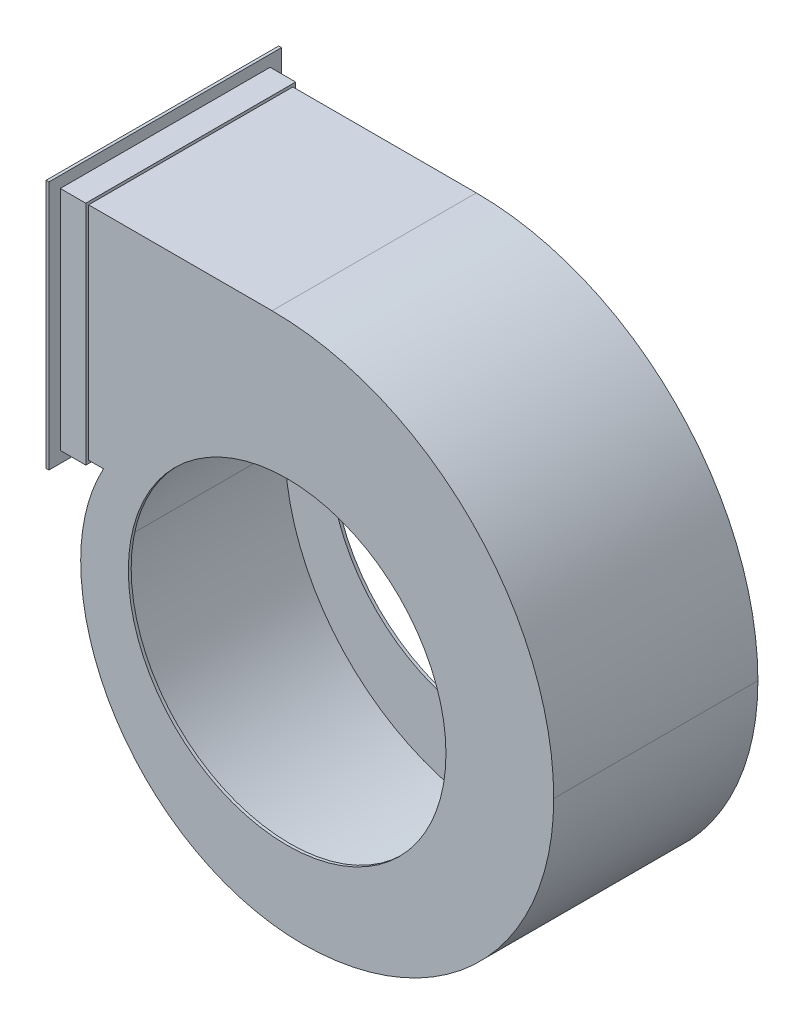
ISO-10303-21;
HEADER;
FILE_DESCRIPTION(('STEP AP214'),'2;1');
FILE_NAME('part.step','',(''),(''),'','','');
FILE_SCHEMA(('AUTOMOTIVE_DESIGN { 1 0 10303 214 1 1 1 1 }'));
ENDSEC;
DATA;
#1=APPLICATION_CONTEXT('core data for automotive mechanical design processes');
#2=APPLICATION_PROTOCOL_DEFINITION('international standard','automotive_design',2000,#1);
#3=PRODUCT_CONTEXT('',#1,'mechanical');
#4=PRODUCT('Part','Part','',(#3));
#5=PRODUCT_RELATED_PRODUCT_CATEGORY('part','',(#4));
#6=PRODUCT_DEFINITION_FORMATION('','',#4);
#7=PRODUCT_DEFINITION_CONTEXT('part definition',#1,'design');
#8=PRODUCT_DEFINITION('design','',#6,#7);
#9=PRODUCT_DEFINITION_SHAPE('','',#8);
#10=(LENGTH_UNIT() NAMED_UNIT(*) SI_UNIT(.MILLI.,.METRE.));
#11=(NAMED_UNIT(*) PLANE_ANGLE_UNIT() SI_UNIT($,.RADIAN.));
#12=(NAMED_UNIT(*) SI_UNIT($,.STERADIAN.) SOLID_ANGLE_UNIT());
#13=UNCERTAINTY_MEASURE_WITH_UNIT(LENGTH_MEASURE(1.E-05),#10,'distance_accuracy_value','');
#14=(GEOMETRIC_REPRESENTATION_CONTEXT(3) GLOBAL_UNCERTAINTY_ASSIGNED_CONTEXT((#13)) GLOBAL_UNIT_ASSIGNED_CONTEXT((#10,
#11,#12)) REPRESENTATION_CONTEXT('',''));
#15=CARTESIAN_POINT('',(0.,0.,0.));
#16=DIRECTION('',(0.,0.,1.));
#17=DIRECTION('',(1.,0.,0.));
#18=AXIS2_PLACEMENT_3D('',#15,#16,#17);
#19=CARTESIAN_POINT('',(-400.,528.007277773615,185.));
#20=DIRECTION('',(0.,0.,-1.));
#21=DIRECTION('',(-1.,0.,0.));
#22=AXIS2_PLACEMENT_3D('',#19,#20,#21);
#23=PLANE('',#22);
#24=DIRECTION('',(0.,1.,0.));
#25=VECTOR('',#24,1.);
#26=CARTESIAN_POINT('',(-395.,128.007277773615,185.));
#27=LINE('',#26,#25);
#28=CARTESIAN_POINT('',(-395.,128.007277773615,185.));
#29=VERTEX_POINT('',#28);
#30=CARTESIAN_POINT('',(-395.,528.007277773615,185.));
#31=VERTEX_POINT('',#30);
#32=EDGE_CURVE('E142',#29,#31,#27,.T.);
#33=ORIENTED_EDGE('',*,*,#32,.F.);
#34=DIRECTION('',(1.,0.,0.));
#35=VECTOR('',#34,1.);
#36=CARTESIAN_POINT('',(-400.,128.007277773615,185.));
#37=LINE('',#36,#35);
#38=CARTESIAN_POINT('',(-350.,128.007277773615,185.));
#39=VERTEX_POINT('',#38);
#40=EDGE_CURVE('E128',#29,#39,#37,.T.);
#41=ORIENTED_EDGE('',*,*,#40,.T.);
#42=DIRECTION('',(0.,1.,0.));
#43=VECTOR('',#42,1.);
#44=CARTESIAN_POINT('',(-350.,528.007277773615,185.));
#45=LINE('',#44,#43);
#46=CARTESIAN_POINT('',(-350.,528.007277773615,185.));
#47=VERTEX_POINT('',#46);
#48=EDGE_CURVE('E195',#39,#47,#45,.T.);
#49=ORIENTED_EDGE('',*,*,#48,.T.);
#50=DIRECTION('',(1.,0.,0.));
#51=VECTOR('',#50,1.);
#52=CARTESIAN_POINT('',(-400.,528.007277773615,185.));
#53=LINE('',#52,#51);
#54=EDGE_CURVE('E12',#31,#47,#53,.T.);
#55=ORIENTED_EDGE('',*,*,#54,.F.);
#56=EDGE_LOOP('',(#33,#41,#49,#55));
#57=FACE_BOUND('',#56,.T.);
#58=ADVANCED_FACE('F41',(#57),#23,.F.);
#59=CARTESIAN_POINT('',(-400.,528.007277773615,185.));
#60=DIRECTION('',(0.,-1.,0.));
#61=DIRECTION('',(1.,0.,0.));
#62=AXIS2_PLACEMENT_3D('',#59,#60,#61);
#63=PLANE('',#62);
#64=DIRECTION('',(0.,0.,-1.));
#65=VECTOR('',#64,1.);
#66=CARTESIAN_POINT('',(-395.,528.007277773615,185.));
#67=LINE('',#66,#65);
#68=CARTESIAN_POINT('',(-395.,528.007277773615,-185.));
#69=VERTEX_POINT('',#68);
#70=EDGE_CURVE('E54',#31,#69,#67,.T.);
#71=ORIENTED_EDGE('',*,*,#70,.F.);
#72=ORIENTED_EDGE('',*,*,#54,.T.);
#73=DIRECTION('',(0.,0.,-1.));
#74=VECTOR('',#73,1.);
#75=CARTESIAN_POINT('',(-350.,528.007277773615,185.));
#76=LINE('',#75,#74);
#77=CARTESIAN_POINT('',(-350.,528.007277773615,-185.));
#78=VERTEX_POINT('',#77);
#79=EDGE_CURVE('E197',#47,#78,#76,.T.);
#80=ORIENTED_EDGE('',*,*,#79,.T.);
#81=DIRECTION('',(1.,0.,0.));
#82=VECTOR('',#81,1.);
#83=CARTESIAN_POINT('',(-400.,528.007277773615,-185.));
#84=LINE('',#83,#82);
#85=EDGE_CURVE('E48',#69,#78,#84,.T.);
#86=ORIENTED_EDGE('',*,*,#85,.F.);
#87=EDGE_LOOP('',(#71,#72,#80,#86));
#88=FACE_BOUND('',#87,.T.);
#89=ADVANCED_FACE('F225',(#88),#63,.F.);
#90=CARTESIAN_POINT('',(-400.,528.007277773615,-185.));
#91=DIRECTION('',(0.,0.,1.));
#92=DIRECTION('',(1.,0.,0.));
#93=AXIS2_PLACEMENT_3D('',#90,#91,#92);
#94=PLANE('',#93);
#95=DIRECTION('',(0.,-1.,0.));
#96=VECTOR('',#95,1.);
#97=CARTESIAN_POINT('',(-395.,528.007277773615,-185.));
#98=LINE('',#97,#96);
#99=CARTESIAN_POINT('',(-395.,128.007277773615,-185.));
#100=VERTEX_POINT('',#99);
#101=EDGE_CURVE('E62',#69,#100,#98,.T.);
#102=ORIENTED_EDGE('',*,*,#101,.F.);
#103=ORIENTED_EDGE('',*,*,#85,.T.);
#104=DIRECTION('',(0.,-1.,0.));
#105=VECTOR('',#104,1.);
#106=CARTESIAN_POINT('',(-350.,528.007277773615,-185.));
#107=LINE('',#106,#105);
#108=CARTESIAN_POINT('',(-350.,128.007277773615,-185.));
#109=VERTEX_POINT('',#108);
#110=EDGE_CURVE('E200',#78,#109,#107,.T.);
#111=ORIENTED_EDGE('',*,*,#110,.T.);
#112=DIRECTION('',(1.,0.,0.));
#113=VECTOR('',#112,1.);
#114=CARTESIAN_POINT('',(-400.,128.007277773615,-185.));
#115=LINE('',#114,#113);
#116=EDGE_CURVE('E138',#100,#109,#115,.T.);
#117=ORIENTED_EDGE('',*,*,#116,.F.);
#118=EDGE_LOOP('',(#102,#103,#111,#117));
#119=FACE_BOUND('',#118,.T.);
#120=ADVANCED_FACE('F221',(#119),#94,.F.);
#121=CARTESIAN_POINT('',(-400.,128.007277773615,185.));
#122=DIRECTION('',(0.,1.,0.));
#123=DIRECTION('',(-1.,0.,0.));
#124=AXIS2_PLACEMENT_3D('',#121,#122,#123);
#125=PLANE('',#124);
#126=DIRECTION('',(0.,0.,1.));
#127=VECTOR('',#126,1.);
#128=CARTESIAN_POINT('',(-395.,128.007277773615,-185.));
#129=LINE('',#128,#127);
#130=EDGE_CURVE('E132',#100,#29,#129,.T.);
#131=ORIENTED_EDGE('',*,*,#130,.F.);
#132=ORIENTED_EDGE('',*,*,#116,.T.);
#133=DIRECTION('',(0.,0.,1.));
#134=VECTOR('',#133,1.);
#135=CARTESIAN_POINT('',(-350.,128.007277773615,185.));
#136=LINE('',#135,#134);
#137=EDGE_CURVE('E134',#109,#39,#136,.T.);
#138=ORIENTED_EDGE('',*,*,#137,.T.);
#139=ORIENTED_EDGE('',*,*,#40,.F.);
#140=EDGE_LOOP('',(#131,#132,#138,#139));
#141=FACE_BOUND('',#140,.T.);
#142=ADVANCED_FACE('F130',(#141),#125,.F.);
#143=CARTESIAN_POINT('',(-400.,128.007277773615,185.));
#144=DIRECTION('',(1.,0.,0.));
#145=DIRECTION('',(0.,1.,0.));
#146=AXIS2_PLACEMENT_3D('',#143,#144,#145);
#147=PLANE('',#146);
#148=DIRECTION('',(0.,1.,0.));
#149=VECTOR('',#148,1.);
#150=CARTESIAN_POINT('',(-400.,523.007277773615,180.));
#151=LINE('',#150,#149);
#152=CARTESIAN_POINT('',(-400.,133.007277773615,180.));
#153=VERTEX_POINT('',#152);
#154=CARTESIAN_POINT('',(-400.,523.007277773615,180.));
#155=VERTEX_POINT('',#154);
#156=EDGE_CURVE('E204',#153,#155,#151,.T.);
#157=ORIENTED_EDGE('',*,*,#156,.F.);
#158=DIRECTION('',(0.,0.,1.));
#159=VECTOR('',#158,1.);
#160=CARTESIAN_POINT('',(-400.,133.007277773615,180.));
#161=LINE('',#160,#159);
#162=CARTESIAN_POINT('',(-400.,133.007277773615,-180.));
#163=VERTEX_POINT('',#162);
#164=EDGE_CURVE('E211',#163,#153,#161,.T.);
#165=ORIENTED_EDGE('',*,*,#164,.F.);
#166=DIRECTION('',(0.,-1.,0.));
#167=VECTOR('',#166,1.);
#168=CARTESIAN_POINT('',(-400.,523.007277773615,-180.));
#169=LINE('',#168,#167);
#170=CARTESIAN_POINT('',(-400.,523.007277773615,-180.));
#171=VERTEX_POINT('',#170);
#172=EDGE_CURVE('E208',#171,#163,#169,.T.);
#173=ORIENTED_EDGE('',*,*,#172,.F.);
#174=DIRECTION('',(0.,0.,-1.));
#175=VECTOR('',#174,1.);
#176=CARTESIAN_POINT('',(-400.,523.007277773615,180.));
#177=LINE('',#176,#175);
#178=EDGE_CURVE('E206',#155,#171,#177,.T.);
#179=ORIENTED_EDGE('',*,*,#178,.F.);
#180=EDGE_LOOP('',(#157,#165,#173,#179));
#181=FACE_BOUND('',#180,.T.);
#182=DIRECTION('',(0.,0.,-1.));
#183=VECTOR('',#182,1.);
#184=CARTESIAN_POINT('',(-400.,548.007277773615,205.));
#185=LINE('',#184,#183);
#186=CARTESIAN_POINT('',(-400.,548.007277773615,205.));
#187=VERTEX_POINT('',#186);
#188=CARTESIAN_POINT('',(-400.,548.007277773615,-205.));
#189=VERTEX_POINT('',#188);
#190=EDGE_CURVE('E144',#187,#189,#185,.T.);
#191=ORIENTED_EDGE('',*,*,#190,.T.);
#192=DIRECTION('',(0.,-1.,0.));
#193=VECTOR('',#192,1.);
#194=CARTESIAN_POINT('',(-400.,548.007277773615,-205.));
#195=LINE('',#194,#193);
#196=CARTESIAN_POINT('',(-400.,108.007277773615,-205.));
#197=VERTEX_POINT('',#196);
#198=EDGE_CURVE('E168',#189,#197,#195,.T.);
#199=ORIENTED_EDGE('',*,*,#198,.T.);
#200=DIRECTION('',(0.,0.,1.));
#201=VECTOR('',#200,1.);
#202=CARTESIAN_POINT('',(-400.,108.007277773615,-205.));
#203=LINE('',#202,#201);
#204=CARTESIAN_POINT('',(-400.,108.007277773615,205.));
#205=VERTEX_POINT('',#204);
#206=EDGE_CURVE('E171',#197,#205,#203,.T.);
#207=ORIENTED_EDGE('',*,*,#206,.T.);
#208=DIRECTION('',(0.,1.,0.));
#209=VECTOR('',#208,1.);
#210=CARTESIAN_POINT('',(-400.,108.007277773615,205.));
#211=LINE('',#210,#209);
#212=EDGE_CURVE('E156',#205,#187,#211,.T.);
#213=ORIENTED_EDGE('',*,*,#212,.T.);
#214=EDGE_LOOP('',(#191,#199,#207,#213));
#215=FACE_BOUND('',#214,.T.);
#216=ADVANCED_FACE('F235',(#181,#215),#147,.F.);
#217=CARTESIAN_POINT('',(-400.,523.007277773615,180.));
#218=DIRECTION('',(0.,0.,-1.));
#219=DIRECTION('',(-1.,0.,0.));
#220=AXIS2_PLACEMENT_3D('',#217,#218,#219);
#221=PLANE('',#220);
#222=DIRECTION('',(1.,0.,0.));
#223=VECTOR('',#222,1.);
#224=CARTESIAN_POINT('',(-400.,523.007277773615,180.));
#225=LINE('',#224,#223);
#226=CARTESIAN_POINT('',(-350.,523.007277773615,180.));
#227=VERTEX_POINT('',#226);
#228=EDGE_CURVE('E139',#155,#227,#225,.T.);
#229=ORIENTED_EDGE('',*,*,#228,.T.);
#230=DIRECTION('',(0.,1.,0.));
#231=VECTOR('',#230,1.);
#232=CARTESIAN_POINT('',(-350.,523.007277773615,180.));
#233=LINE('',#232,#231);
#234=CARTESIAN_POINT('',(-350.,133.007277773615,180.));
#235=VERTEX_POINT('',#234);
#236=EDGE_CURVE('E178',#235,#227,#233,.T.);
#237=ORIENTED_EDGE('',*,*,#236,.F.);
#238=DIRECTION('',(1.,0.,0.));
#239=VECTOR('',#238,1.);
#240=CARTESIAN_POINT('',(-400.,133.007277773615,180.));
#241=LINE('',#240,#239);
#242=EDGE_CURVE('E213',#153,#235,#241,.T.);
#243=ORIENTED_EDGE('',*,*,#242,.F.);
#244=ORIENTED_EDGE('',*,*,#156,.T.);
#245=EDGE_LOOP('',(#229,#237,#243,#244));
#246=FACE_BOUND('',#245,.T.);
#247=ADVANCED_FACE('F238',(#246),#221,.T.);
#248=CARTESIAN_POINT('',(-400.,523.007277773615,180.));
#249=DIRECTION('',(0.,-1.,0.));
#250=DIRECTION('',(1.,0.,0.));
#251=AXIS2_PLACEMENT_3D('',#248,#249,#250);
#252=PLANE('',#251);
#253=DIRECTION('',(1.,0.,0.));
#254=VECTOR('',#253,1.);
#255=CARTESIAN_POINT('',(-400.,523.007277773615,-180.));
#256=LINE('',#255,#254);
#257=CARTESIAN_POINT('',(-350.,523.007277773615,-180.));
#258=VERTEX_POINT('',#257);
#259=EDGE_CURVE('E217',#171,#258,#256,.T.);
#260=ORIENTED_EDGE('',*,*,#259,.T.);
#261=DIRECTION('',(0.,0.,-1.));
#262=VECTOR('',#261,1.);
#263=CARTESIAN_POINT('',(-350.,523.007277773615,180.));
#264=LINE('',#263,#262);
#265=EDGE_CURVE('E186',#227,#258,#264,.T.);
#266=ORIENTED_EDGE('',*,*,#265,.F.);
#267=ORIENTED_EDGE('',*,*,#228,.F.);
#268=ORIENTED_EDGE('',*,*,#178,.T.);
#269=EDGE_LOOP('',(#260,#266,#267,#268));
#270=FACE_BOUND('',#269,.T.);
#271=ADVANCED_FACE('F242',(#270),#252,.T.);
#272=CARTESIAN_POINT('',(-400.,523.007277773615,-180.));
#273=DIRECTION('',(0.,0.,1.));
#274=DIRECTION('',(1.,0.,0.));
#275=AXIS2_PLACEMENT_3D('',#272,#273,#274);
#276=PLANE('',#275);
#277=DIRECTION('',(1.,0.,0.));
#278=VECTOR('',#277,1.);
#279=CARTESIAN_POINT('',(-400.,133.007277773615,-180.));
#280=LINE('',#279,#278);
#281=CARTESIAN_POINT('',(-350.,133.007277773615,-180.));
#282=VERTEX_POINT('',#281);
#283=EDGE_CURVE('E215',#163,#282,#280,.T.);
#284=ORIENTED_EDGE('',*,*,#283,.T.);
#285=DIRECTION('',(0.,-1.,0.));
#286=VECTOR('',#285,1.);
#287=CARTESIAN_POINT('',(-350.,523.007277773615,-180.));
#288=LINE('',#287,#286);
#289=EDGE_CURVE('E189',#258,#282,#288,.T.);
#290=ORIENTED_EDGE('',*,*,#289,.F.);
#291=ORIENTED_EDGE('',*,*,#259,.F.);
#292=ORIENTED_EDGE('',*,*,#172,.T.);
#293=EDGE_LOOP('',(#284,#290,#291,#292));
#294=FACE_BOUND('',#293,.T.);
#295=ADVANCED_FACE('F246',(#294),#276,.T.);
#296=CARTESIAN_POINT('',(-400.,133.007277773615,180.));
#297=DIRECTION('',(0.,1.,0.));
#298=DIRECTION('',(-1.,0.,0.));
#299=AXIS2_PLACEMENT_3D('',#296,#297,#298);
#300=PLANE('',#299);
#301=ORIENTED_EDGE('',*,*,#242,.T.);
#302=DIRECTION('',(0.,0.,1.));
#303=VECTOR('',#302,1.);
#304=CARTESIAN_POINT('',(-350.,133.007277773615,180.));
#305=LINE('',#304,#303);
#306=EDGE_CURVE('E192',#282,#235,#305,.T.);
#307=ORIENTED_EDGE('',*,*,#306,.F.);
#308=ORIENTED_EDGE('',*,*,#283,.F.);
#309=ORIENTED_EDGE('',*,*,#164,.T.);
#310=EDGE_LOOP('',(#301,#307,#308,#309));
#311=FACE_BOUND('',#310,.T.);
#312=ADVANCED_FACE('F250',(#311),#300,.T.);
#313=CARTESIAN_POINT('',(-350.,128.007277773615,185.));
#314=DIRECTION('',(1.,0.,0.));
#315=DIRECTION('',(0.,1.,0.));
#316=AXIS2_PLACEMENT_3D('',#313,#314,#315);
#317=PLANE('',#316);
#318=ORIENTED_EDGE('',*,*,#236,.T.);
#319=ORIENTED_EDGE('',*,*,#265,.T.);
#320=ORIENTED_EDGE('',*,*,#289,.T.);
#321=ORIENTED_EDGE('',*,*,#306,.T.);
#322=EDGE_LOOP('',(#318,#319,#320,#321));
#323=FACE_BOUND('',#322,.T.);
#324=ORIENTED_EDGE('',*,*,#48,.F.);
#325=ORIENTED_EDGE('',*,*,#137,.F.);
#326=ORIENTED_EDGE('',*,*,#110,.F.);
#327=ORIENTED_EDGE('',*,*,#79,.F.);
#328=EDGE_LOOP('',(#324,#325,#326,#327));
#329=FACE_BOUND('',#328,.T.);
#330=ADVANCED_FACE('F224',(#323,#329),#317,.T.);
#331=CARTESIAN_POINT('',(-395.,548.007277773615,205.));
#332=DIRECTION('',(0.,1.,0.));
#333=DIRECTION('',(-1.,0.,0.));
#334=AXIS2_PLACEMENT_3D('',#331,#332,#333);
#335=PLANE('',#334);
#336=ORIENTED_EDGE('',*,*,#190,.F.);
#337=DIRECTION('',(-1.,0.,0.));
#338=VECTOR('',#337,1.);
#339=CARTESIAN_POINT('',(-395.,548.007277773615,205.));
#340=LINE('',#339,#338);
#341=CARTESIAN_POINT('',(-395.,548.007277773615,205.));
#342=VERTEX_POINT('',#341);
#343=EDGE_CURVE('E176',#342,#187,#340,.T.);
#344=ORIENTED_EDGE('',*,*,#343,.F.);
#345=DIRECTION('',(0.,0.,-1.));
#346=VECTOR('',#345,1.);
#347=CARTESIAN_POINT('',(-395.,548.007277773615,205.));
#348=LINE('',#347,#346);
#349=CARTESIAN_POINT('',(-395.,548.007277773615,-205.));
#350=VERTEX_POINT('',#349);
#351=EDGE_CURVE('E152',#342,#350,#348,.T.);
#352=ORIENTED_EDGE('',*,*,#351,.T.);
#353=DIRECTION('',(-1.,0.,0.));
#354=VECTOR('',#353,1.);
#355=CARTESIAN_POINT('',(-395.,548.007277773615,-205.));
#356=LINE('',#355,#354);
#357=EDGE_CURVE('E165',#350,#189,#356,.T.);
#358=ORIENTED_EDGE('',*,*,#357,.T.);
#359=EDGE_LOOP('',(#336,#344,#352,#358));
#360=FACE_BOUND('',#359,.T.);
#361=ADVANCED_FACE('F257',(#360),#335,.T.);
#362=CARTESIAN_POINT('',(-395.,108.007277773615,205.));
#363=DIRECTION('',(0.,0.,1.));
#364=DIRECTION('',(1.,0.,0.));
#365=AXIS2_PLACEMENT_3D('',#362,#363,#364);
#366=PLANE('',#365);
#367=ORIENTED_EDGE('',*,*,#212,.F.);
#368=DIRECTION('',(-1.,0.,0.));
#369=VECTOR('',#368,1.);
#370=CARTESIAN_POINT('',(-395.,108.007277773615,205.));
#371=LINE('',#370,#369);
#372=CARTESIAN_POINT('',(-395.,108.007277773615,205.));
#373=VERTEX_POINT('',#372);
#374=EDGE_CURVE('E179',#373,#205,#371,.T.);
#375=ORIENTED_EDGE('',*,*,#374,.F.);
#376=DIRECTION('',(0.,1.,0.));
#377=VECTOR('',#376,1.);
#378=CARTESIAN_POINT('',(-395.,108.007277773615,205.));
#379=LINE('',#378,#377);
#380=EDGE_CURVE('E162',#373,#342,#379,.T.);
#381=ORIENTED_EDGE('',*,*,#380,.T.);
#382=ORIENTED_EDGE('',*,*,#343,.T.);
#383=EDGE_LOOP('',(#367,#375,#381,#382));
#384=FACE_BOUND('',#383,.T.);
#385=ADVANCED_FACE('F261',(#384),#366,.T.);
#386=CARTESIAN_POINT('',(-395.,108.007277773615,-205.));
#387=DIRECTION('',(0.,-1.,0.));
#388=DIRECTION('',(1.,0.,0.));
#389=AXIS2_PLACEMENT_3D('',#386,#387,#388);
#390=PLANE('',#389);
#391=ORIENTED_EDGE('',*,*,#206,.F.);
#392=DIRECTION('',(-1.,0.,0.));
#393=VECTOR('',#392,1.);
#394=CARTESIAN_POINT('',(-395.,108.007277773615,-205.));
#395=LINE('',#394,#393);
#396=CARTESIAN_POINT('',(-395.,108.007277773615,-205.));
#397=VERTEX_POINT('',#396);
#398=EDGE_CURVE('E181',#397,#197,#395,.T.);
#399=ORIENTED_EDGE('',*,*,#398,.F.);
#400=DIRECTION('',(0.,0.,1.));
#401=VECTOR('',#400,1.);
#402=CARTESIAN_POINT('',(-395.,108.007277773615,-205.));
#403=LINE('',#402,#401);
#404=EDGE_CURVE('E159',#397,#373,#403,.T.);
#405=ORIENTED_EDGE('',*,*,#404,.T.);
#406=ORIENTED_EDGE('',*,*,#374,.T.);
#407=EDGE_LOOP('',(#391,#399,#405,#406));
#408=FACE_BOUND('',#407,.T.);
#409=ADVANCED_FACE('F266',(#408),#390,.T.);
#410=CARTESIAN_POINT('',(-395.,548.007277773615,-205.));
#411=DIRECTION('',(0.,0.,-1.));
#412=DIRECTION('',(0.,1.,0.));
#413=AXIS2_PLACEMENT_3D('',#410,#411,#412);
#414=PLANE('',#413);
#415=ORIENTED_EDGE('',*,*,#198,.F.);
#416=ORIENTED_EDGE('',*,*,#357,.F.);
#417=DIRECTION('',(0.,-1.,0.));
#418=VECTOR('',#417,1.);
#419=CARTESIAN_POINT('',(-395.,548.007277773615,-205.));
#420=LINE('',#419,#418);
#421=EDGE_CURVE('E155',#350,#397,#420,.T.);
#422=ORIENTED_EDGE('',*,*,#421,.T.);
#423=ORIENTED_EDGE('',*,*,#398,.T.);
#424=EDGE_LOOP('',(#415,#416,#422,#423));
#425=FACE_BOUND('',#424,.T.);
#426=ADVANCED_FACE('F263',(#425),#414,.T.);
#427=CARTESIAN_POINT('',(-395.,548.007277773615,-205.));
#428=DIRECTION('',(-1.,0.,0.));
#429=DIRECTION('',(0.,-1.,0.));
#430=AXIS2_PLACEMENT_3D('',#427,#428,#429);
#431=PLANE('',#430);
#432=ORIENTED_EDGE('',*,*,#32,.T.);
#433=ORIENTED_EDGE('',*,*,#70,.T.);
#434=ORIENTED_EDGE('',*,*,#101,.T.);
#435=ORIENTED_EDGE('',*,*,#130,.T.);
#436=EDGE_LOOP('',(#432,#433,#434,#435));
#437=FACE_BOUND('',#436,.T.);
#438=ORIENTED_EDGE('',*,*,#351,.F.);
#439=ORIENTED_EDGE('',*,*,#380,.F.);
#440=ORIENTED_EDGE('',*,*,#404,.F.);
#441=ORIENTED_EDGE('',*,*,#421,.F.);
#442=EDGE_LOOP('',(#438,#439,#440,#441));
#443=FACE_BOUND('',#442,.T.);
#444=ADVANCED_FACE('F146',(#437,#443),#431,.F.);
#445=CLOSED_SHELL('',(#58,#89,#120,#142,#216,#247,#271,#295,#312,#330,#361,#385,#409,#426,#444));
#446=MANIFOLD_SOLID_BREP('B2',#445);
#447=CARTESIAN_POINT('',(-380.,523.007277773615,180.));
#448=DIRECTION('',(1.,0.,0.));
#449=DIRECTION('',(0.,1.,0.));
#450=AXIS2_PLACEMENT_3D('',#447,#448,#449);
#451=PLANE('',#450);
#452=DIRECTION('',(0.,-1.,0.));
#453=VECTOR('',#452,1.);
#454=CARTESIAN_POINT('',(-380.,523.007277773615,-180.));
#455=LINE('',#454,#453);
#456=CARTESIAN_POINT('',(-380.,523.007277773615,-180.));
#457=VERTEX_POINT('',#456);
#458=CARTESIAN_POINT('',(-380.,133.007277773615,-180.));
#459=VERTEX_POINT('',#458);
#460=EDGE_CURVE('E501',#457,#459,#455,.T.);
#461=ORIENTED_EDGE('',*,*,#460,.T.);
#462=DIRECTION('',(0.,0.,-1.));
#463=VECTOR('',#462,1.);
#464=CARTESIAN_POINT('',(-380.,133.007277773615,180.));
#465=LINE('',#464,#463);
#466=CARTESIAN_POINT('',(-380.,133.007277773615,180.));
#467=VERTEX_POINT('',#466);
#468=EDGE_CURVE('E484',#467,#459,#465,.T.);
#469=ORIENTED_EDGE('',*,*,#468,.F.);
#470=DIRECTION('',(0.,-1.,0.));
#471=VECTOR('',#470,1.);
#472=CARTESIAN_POINT('',(-380.,523.007277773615,180.));
#473=LINE('',#472,#471);
#474=CARTESIAN_POINT('',(-380.,523.007277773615,180.));
#475=VERTEX_POINT('',#474);
#476=EDGE_CURVE('E472',#475,#467,#473,.T.);
#477=ORIENTED_EDGE('',*,*,#476,.F.);
#478=DIRECTION('',(0.,0.,-1.));
#479=VECTOR('',#478,1.);
#480=CARTESIAN_POINT('',(-380.,523.007277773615,180.));
#481=LINE('',#480,#479);
#482=EDGE_CURVE('E511',#475,#457,#481,.T.);
#483=ORIENTED_EDGE('',*,*,#482,.T.);
#484=EDGE_LOOP('',(#461,#469,#477,#483));
#485=FACE_BOUND('',#484,.T.);
#486=DIRECTION('',(0.,-1.,0.));
#487=VECTOR('',#486,1.);
#488=CARTESIAN_POINT('',(-380.,523.007277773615,-175.));
#489=LINE('',#488,#487);
#490=CARTESIAN_POINT('',(-380.,518.007277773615,-175.));
#491=VERTEX_POINT('',#490);
#492=CARTESIAN_POINT('',(-380.,138.007277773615,-175.));
#493=VERTEX_POINT('',#492);
#494=EDGE_CURVE('E539',#491,#493,#489,.T.);
#495=ORIENTED_EDGE('',*,*,#494,.F.);
#496=DIRECTION('',(0.,0.,-1.));
#497=VECTOR('',#496,1.);
#498=CARTESIAN_POINT('',(-380.,518.007277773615,180.));
#499=LINE('',#498,#497);
#500=CARTESIAN_POINT('',(-380.,518.007277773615,175.));
#501=VERTEX_POINT('',#500);
#502=EDGE_CURVE('E537',#501,#491,#499,.T.);
#503=ORIENTED_EDGE('',*,*,#502,.F.);
#504=DIRECTION('',(0.,-1.,0.));
#505=VECTOR('',#504,1.);
#506=CARTESIAN_POINT('',(-380.,523.007277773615,175.));
#507=LINE('',#506,#505);
#508=CARTESIAN_POINT('',(-380.,138.007277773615,175.));
#509=VERTEX_POINT('',#508);
#510=EDGE_CURVE('E405',#501,#509,#507,.T.);
#511=ORIENTED_EDGE('',*,*,#510,.T.);
#512=DIRECTION('',(0.,0.,-1.));
#513=VECTOR('',#512,1.);
#514=CARTESIAN_POINT('',(-380.,138.007277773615,180.));
#515=LINE('',#514,#513);
#516=EDGE_CURVE('E534',#509,#493,#515,.T.);
#517=ORIENTED_EDGE('',*,*,#516,.T.);
#518=EDGE_LOOP('',(#495,#503,#511,#517));
#519=FACE_BOUND('',#518,.T.);
#520=ADVANCED_FACE('F389',(#485,#519),#451,.F.);
#521=CARTESIAN_POINT('',(26.5036388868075,26.5036388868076,180.));
#522=DIRECTION('',(0.,0.,-1.));
#523=DIRECTION('',(-1.,0.,0.));
#524=AXIS2_PLACEMENT_3D('',#521,#522,#523);
#525=CYLINDRICAL_SURFACE('',#524,443.496361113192);
#526=CARTESIAN_POINT('',(26.5036388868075,26.5036388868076,-180.));
#527=DIRECTION('',(0.,0.,1.));
#528=DIRECTION('',(1.,0.,0.));
#529=AXIS2_PLACEMENT_3D('',#526,#527,#528);
#530=CIRCLE('',#529,443.496361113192);
#531=CARTESIAN_POINT('',(26.5036388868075,-416.992722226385,-180.));
#532=VERTEX_POINT('',#531);
#533=CARTESIAN_POINT('',(470.,26.5036388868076,-180.));
#534=VERTEX_POINT('',#533);
#535=EDGE_CURVE('E493',#532,#534,#530,.T.);
#536=ORIENTED_EDGE('',*,*,#535,.T.);
#537=DIRECTION('',(0.,0.,-1.));
#538=VECTOR('',#537,1.);
#539=CARTESIAN_POINT('',(470.,26.5036388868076,180.));
#540=LINE('',#539,#538);
#541=CARTESIAN_POINT('',(470.,26.5036388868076,180.));
#542=VERTEX_POINT('',#541);
#543=EDGE_CURVE('E39',#542,#534,#540,.T.);
#544=ORIENTED_EDGE('',*,*,#543,.F.);
#545=CARTESIAN_POINT('',(26.5036388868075,26.5036388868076,180.));
#546=DIRECTION('',(0.,0.,1.));
#547=DIRECTION('',(1.,0.,0.));
#548=AXIS2_PLACEMENT_3D('',#545,#546,#547);
#549=CIRCLE('',#548,443.496361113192);
#550=CARTESIAN_POINT('',(26.5036388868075,-416.992722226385,180.));
#551=VERTEX_POINT('',#550);
#552=EDGE_CURVE('E507',#551,#542,#549,.T.);
#553=ORIENTED_EDGE('',*,*,#552,.F.);
#554=DIRECTION('',(0.,0.,-1.));
#555=VECTOR('',#554,1.);
#556=CARTESIAN_POINT('',(26.5036388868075,-416.992722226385,180.));
#557=LINE('',#556,#555);
#558=EDGE_CURVE('E489',#551,#532,#557,.T.);
#559=ORIENTED_EDGE('',*,*,#558,.T.);
#560=EDGE_LOOP('',(#536,#544,#553,#559));
#561=FACE_BOUND('',#560,.T.);
#562=ADVANCED_FACE('F391',(#561),#525,.T.);
#563=CARTESIAN_POINT('',(-26.5036388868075,26.5036388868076,180.));
#564=DIRECTION('',(0.,0.,-1.));
#565=DIRECTION('',(-1.,0.,0.));
#566=AXIS2_PLACEMENT_3D('',#563,#564,#565);
#567=CYLINDRICAL_SURFACE('',#566,496.503638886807);
#568=CARTESIAN_POINT('',(-26.5036388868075,26.5036388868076,-180.));
#569=DIRECTION('',(0.,0.,1.));
#570=DIRECTION('',(1.,0.,0.));
#571=AXIS2_PLACEMENT_3D('',#568,#569,#570);
#572=CIRCLE('',#571,496.503638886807);
#573=CARTESIAN_POINT('',(-26.5036388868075,523.007277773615,-180.));
#574=VERTEX_POINT('',#573);
#575=EDGE_CURVE('E496',#534,#574,#572,.T.);
#576=ORIENTED_EDGE('',*,*,#575,.T.);
#577=DIRECTION('',(0.,0.,-1.));
#578=VECTOR('',#577,1.);
#579=CARTESIAN_POINT('',(-26.5036388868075,523.007277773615,180.));
#580=LINE('',#579,#578);
#581=CARTESIAN_POINT('',(-26.5036388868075,523.007277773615,180.));
#582=VERTEX_POINT('',#581);
#583=EDGE_CURVE('E398',#582,#574,#580,.T.);
#584=ORIENTED_EDGE('',*,*,#583,.F.);
#585=CARTESIAN_POINT('',(-26.5036388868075,26.5036388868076,180.));
#586=DIRECTION('',(0.,0.,1.));
#587=DIRECTION('',(1.,0.,0.));
#588=AXIS2_PLACEMENT_3D('',#585,#586,#587);
#589=CIRCLE('',#588,496.503638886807);
#590=EDGE_CURVE('E452',#542,#582,#589,.T.);
#591=ORIENTED_EDGE('',*,*,#590,.F.);
#592=ORIENTED_EDGE('',*,*,#543,.T.);
#593=EDGE_LOOP('',(#576,#584,#591,#592));
#594=FACE_BOUND('',#593,.T.);
#595=ADVANCED_FACE('F670',(#594),#567,.T.);
#596=CARTESIAN_POINT('',(-26.5036388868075,523.007277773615,180.));
#597=DIRECTION('',(0.,-1.,0.));
#598=DIRECTION('',(0.,0.,-1.));
#599=AXIS2_PLACEMENT_3D('',#596,#597,#598);
#600=PLANE('',#599);
#601=DIRECTION('',(-1.,0.,0.));
#602=VECTOR('',#601,1.);
#603=CARTESIAN_POINT('',(-26.5036388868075,523.007277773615,-180.));
#604=LINE('',#603,#602);
#605=EDGE_CURVE('E499',#574,#457,#604,.T.);
#606=ORIENTED_EDGE('',*,*,#605,.T.);
#607=ORIENTED_EDGE('',*,*,#482,.F.);
#608=DIRECTION('',(-1.,0.,0.));
#609=VECTOR('',#608,1.);
#610=CARTESIAN_POINT('',(-26.5036388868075,523.007277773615,180.));
#611=LINE('',#610,#609);
#612=EDGE_CURVE('E520',#582,#475,#611,.T.);
#613=ORIENTED_EDGE('',*,*,#612,.F.);
#614=ORIENTED_EDGE('',*,*,#583,.T.);
#615=EDGE_LOOP('',(#606,#607,#613,#614));
#616=FACE_BOUND('',#615,.T.);
#617=ADVANCED_FACE('F518',(#616),#600,.F.);
#618=CARTESIAN_POINT('',(-380.,133.007277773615,180.));
#619=DIRECTION('',(0.,1.,0.));
#620=DIRECTION('',(0.,0.,1.));
#621=AXIS2_PLACEMENT_3D('',#618,#619,#620);
#622=PLANE('',#621);
#623=DIRECTION('',(1.,0.,0.));
#624=VECTOR('',#623,1.);
#625=CARTESIAN_POINT('',(-380.,133.007277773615,-180.));
#626=LINE('',#625,#624);
#627=CARTESIAN_POINT('',(-323.909483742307,133.007277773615,-180.));
#628=VERTEX_POINT('',#627);
#629=EDGE_CURVE('E481',#459,#628,#626,.T.);
#630=ORIENTED_EDGE('',*,*,#629,.T.);
#631=DIRECTION('',(0.,0.,-1.));
#632=VECTOR('',#631,1.);
#633=CARTESIAN_POINT('',(-323.909483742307,133.007277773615,180.));
#634=LINE('',#633,#632);
#635=CARTESIAN_POINT('',(-323.909483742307,133.007277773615,180.));
#636=VERTEX_POINT('',#635);
#637=EDGE_CURVE('E478',#636,#628,#634,.T.);
#638=ORIENTED_EDGE('',*,*,#637,.F.);
#639=DIRECTION('',(1.,0.,0.));
#640=VECTOR('',#639,1.);
#641=CARTESIAN_POINT('',(-380.,133.007277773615,180.));
#642=LINE('',#641,#640);
#643=EDGE_CURVE('E465',#467,#636,#642,.T.);
#644=ORIENTED_EDGE('',*,*,#643,.F.);
#645=ORIENTED_EDGE('',*,*,#468,.T.);
#646=EDGE_LOOP('',(#630,#638,#644,#645));
#647=FACE_BOUND('',#646,.T.);
#648=ADVANCED_FACE('F479',(#647),#622,.F.);
#649=CARTESIAN_POINT('',(-26.5036388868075,-26.5036388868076,180.));
#650=DIRECTION('',(0.,0.,-1.));
#651=DIRECTION('',(-1.,0.,0.));
#652=AXIS2_PLACEMENT_3D('',#649,#650,#651);
#653=CYLINDRICAL_SURFACE('',#652,337.481805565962);
#654=CARTESIAN_POINT('',(-26.5036388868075,-26.5036388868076,-180.));
#655=DIRECTION('',(0.,0.,1.));
#656=DIRECTION('',(1.,0.,0.));
#657=AXIS2_PLACEMENT_3D('',#654,#655,#656);
#658=CIRCLE('',#657,337.481805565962);
#659=CARTESIAN_POINT('',(-363.98544445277,-26.5036388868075,-180.));
#660=VERTEX_POINT('',#659);
#661=EDGE_CURVE('E504',#628,#660,#658,.T.);
#662=ORIENTED_EDGE('',*,*,#661,.T.);
#663=DIRECTION('',(0.,0.,-1.));
#664=VECTOR('',#663,1.);
#665=CARTESIAN_POINT('',(-363.98544445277,-26.5036388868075,180.));
#666=LINE('',#665,#664);
#667=CARTESIAN_POINT('',(-363.98544445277,-26.5036388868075,180.));
#668=VERTEX_POINT('',#667);
#669=EDGE_CURVE('E485',#668,#660,#666,.T.);
#670=ORIENTED_EDGE('',*,*,#669,.F.);
#671=CARTESIAN_POINT('',(-26.5036388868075,-26.5036388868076,180.));
#672=DIRECTION('',(0.,0.,1.));
#673=DIRECTION('',(1.,0.,0.));
#674=AXIS2_PLACEMENT_3D('',#671,#672,#673);
#675=CIRCLE('',#674,337.481805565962);
#676=EDGE_CURVE('E469',#636,#668,#675,.T.);
#677=ORIENTED_EDGE('',*,*,#676,.F.);
#678=ORIENTED_EDGE('',*,*,#637,.T.);
#679=EDGE_LOOP('',(#662,#670,#677,#678));
#680=FACE_BOUND('',#679,.T.);
#681=ADVANCED_FACE('F487',(#680),#653,.T.);
#682=CARTESIAN_POINT('',(26.5036388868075,-26.5036388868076,180.));
#683=DIRECTION('',(0.,0.,-1.));
#684=DIRECTION('',(-1.,0.,0.));
#685=AXIS2_PLACEMENT_3D('',#682,#683,#684);
#686=CYLINDRICAL_SURFACE('',#685,390.489083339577);
#687=CARTESIAN_POINT('',(26.5036388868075,-26.5036388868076,-180.));
#688=DIRECTION('',(0.,0.,1.));
#689=DIRECTION('',(1.,0.,0.));
#690=AXIS2_PLACEMENT_3D('',#687,#688,#689);
#691=CIRCLE('',#690,390.489083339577);
#692=EDGE_CURVE('E444',#660,#532,#691,.T.);
#693=ORIENTED_EDGE('',*,*,#692,.T.);
#694=ORIENTED_EDGE('',*,*,#558,.F.);
#695=CARTESIAN_POINT('',(26.5036388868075,-26.5036388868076,180.));
#696=DIRECTION('',(0.,0.,1.));
#697=DIRECTION('',(1.,0.,0.));
#698=AXIS2_PLACEMENT_3D('',#695,#696,#697);
#699=CIRCLE('',#698,390.489083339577);
#700=EDGE_CURVE('E414',#668,#551,#699,.T.);
#701=ORIENTED_EDGE('',*,*,#700,.F.);
#702=ORIENTED_EDGE('',*,*,#669,.T.);
#703=EDGE_LOOP('',(#693,#694,#701,#702));
#704=FACE_BOUND('',#703,.T.);
#705=ADVANCED_FACE('F681',(#704),#686,.T.);
#706=CARTESIAN_POINT('',(26.5036388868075,26.5036388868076,180.));
#707=DIRECTION('',(0.,0.,1.));
#708=DIRECTION('',(1.,0.,0.));
#709=AXIS2_PLACEMENT_3D('',#706,#707,#708);
#710=PLANE('',#709);
#711=CARTESIAN_POINT('',(0.,0.,180.));
#712=DIRECTION('',(0.,0.,1.));
#713=DIRECTION('',(1.,0.,0.));
#714=AXIS2_PLACEMENT_3D('',#711,#712,#713);
#715=CIRCLE('',#714,280.);
#716=CARTESIAN_POINT('',(280.,0.,180.));
#717=VERTEX_POINT('',#716);
#718=EDGE_CURVE('E593',#717,#717,#715,.T.);
#719=ORIENTED_EDGE('',*,*,#718,.F.);
#720=EDGE_LOOP('',(#719));
#721=FACE_BOUND('',#720,.T.);
#722=ORIENTED_EDGE('',*,*,#552,.T.);
#723=ORIENTED_EDGE('',*,*,#590,.T.);
#724=ORIENTED_EDGE('',*,*,#612,.T.);
#725=ORIENTED_EDGE('',*,*,#476,.T.);
#726=ORIENTED_EDGE('',*,*,#643,.T.);
#727=ORIENTED_EDGE('',*,*,#676,.T.);
#728=ORIENTED_EDGE('',*,*,#700,.T.);
#729=EDGE_LOOP('',(#722,#723,#724,#725,#726,#727,#728));
#730=FACE_BOUND('',#729,.T.);
#731=ADVANCED_FACE('F467',(#721,#730),#710,.T.);
#732=CARTESIAN_POINT('',(26.5036388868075,26.5036388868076,-180.));
#733=DIRECTION('',(0.,0.,1.));
#734=DIRECTION('',(1.,0.,0.));
#735=AXIS2_PLACEMENT_3D('',#732,#733,#734);
#736=PLANE('',#735);
#737=CARTESIAN_POINT('',(0.,0.,-180.));
#738=DIRECTION('',(0.,0.,1.));
#739=DIRECTION('',(1.,0.,0.));
#740=AXIS2_PLACEMENT_3D('',#737,#738,#739);
#741=CIRCLE('',#740,280.);
#742=CARTESIAN_POINT('',(280.,0.,-180.));
#743=VERTEX_POINT('',#742);
#744=EDGE_CURVE('E596',#743,#743,#741,.T.);
#745=ORIENTED_EDGE('',*,*,#744,.T.);
#746=EDGE_LOOP('',(#745));
#747=FACE_BOUND('',#746,.T.);
#748=ORIENTED_EDGE('',*,*,#535,.F.);
#749=ORIENTED_EDGE('',*,*,#692,.F.);
#750=ORIENTED_EDGE('',*,*,#661,.F.);
#751=ORIENTED_EDGE('',*,*,#629,.F.);
#752=ORIENTED_EDGE('',*,*,#460,.F.);
#753=ORIENTED_EDGE('',*,*,#605,.F.);
#754=ORIENTED_EDGE('',*,*,#575,.F.);
#755=EDGE_LOOP('',(#748,#749,#750,#751,#752,#753,#754));
#756=FACE_BOUND('',#755,.T.);
#757=ADVANCED_FACE('F524',(#747,#756),#736,.F.);
#758=CARTESIAN_POINT('',(26.5036388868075,26.5036388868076,180.));
#759=DIRECTION('',(0.,0.,-1.));
#760=DIRECTION('',(-1.,0.,0.));
#761=AXIS2_PLACEMENT_3D('',#758,#759,#760);
#762=CYLINDRICAL_SURFACE('',#761,438.496361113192);
#763=CARTESIAN_POINT('',(26.5036388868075,26.5036388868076,-175.));
#764=DIRECTION('',(0.,0.,1.));
#765=DIRECTION('',(1.,0.,0.));
#766=AXIS2_PLACEMENT_3D('',#763,#764,#765);
#767=CIRCLE('',#766,438.496361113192);
#768=CARTESIAN_POINT('',(26.5036388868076,-411.992722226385,-175.));
#769=VERTEX_POINT('',#768);
#770=CARTESIAN_POINT('',(465.,26.5036388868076,-175.));
#771=VERTEX_POINT('',#770);
#772=EDGE_CURVE('E581',#769,#771,#767,.T.);
#773=ORIENTED_EDGE('',*,*,#772,.F.);
#774=DIRECTION('',(0.,0.,-1.));
#775=VECTOR('',#774,1.);
#776=CARTESIAN_POINT('',(26.5036388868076,-411.992722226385,180.));
#777=LINE('',#776,#775);
#778=CARTESIAN_POINT('',(26.5036388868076,-411.992722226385,175.));
#779=VERTEX_POINT('',#778);
#780=EDGE_CURVE('E555',#779,#769,#777,.T.);
#781=ORIENTED_EDGE('',*,*,#780,.F.);
#782=CARTESIAN_POINT('',(26.5036388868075,26.5036388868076,175.));
#783=DIRECTION('',(0.,0.,1.));
#784=DIRECTION('',(1.,0.,0.));
#785=AXIS2_PLACEMENT_3D('',#782,#783,#784);
#786=CIRCLE('',#785,438.496361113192);
#787=CARTESIAN_POINT('',(465.,26.5036388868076,175.));
#788=VERTEX_POINT('',#787);
#789=EDGE_CURVE('E550',#779,#788,#786,.T.);
#790=ORIENTED_EDGE('',*,*,#789,.T.);
#791=DIRECTION('',(0.,0.,-1.));
#792=VECTOR('',#791,1.);
#793=CARTESIAN_POINT('',(465.,26.5036388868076,180.));
#794=LINE('',#793,#792);
#795=EDGE_CURVE('E497',#788,#771,#794,.T.);
#796=ORIENTED_EDGE('',*,*,#795,.T.);
#797=EDGE_LOOP('',(#773,#781,#790,#796));
#798=FACE_BOUND('',#797,.T.);
#799=ADVANCED_FACE('F620',(#798),#762,.F.);
#800=CARTESIAN_POINT('',(-26.5036388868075,26.5036388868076,180.));
#801=DIRECTION('',(0.,0.,-1.));
#802=DIRECTION('',(-1.,0.,0.));
#803=AXIS2_PLACEMENT_3D('',#800,#801,#802);
#804=CYLINDRICAL_SURFACE('',#803,491.503638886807);
#805=CARTESIAN_POINT('',(-26.5036388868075,26.5036388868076,-175.));
#806=DIRECTION('',(0.,0.,1.));
#807=DIRECTION('',(1.,0.,0.));
#808=AXIS2_PLACEMENT_3D('',#805,#806,#807);
#809=CIRCLE('',#808,491.503638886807);
#810=CARTESIAN_POINT('',(-26.5036388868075,518.007277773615,-175.));
#811=VERTEX_POINT('',#810);
#812=EDGE_CURVE('E574',#771,#811,#809,.T.);
#813=ORIENTED_EDGE('',*,*,#812,.F.);
#814=ORIENTED_EDGE('',*,*,#795,.F.);
#815=CARTESIAN_POINT('',(-26.5036388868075,26.5036388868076,175.));
#816=DIRECTION('',(0.,0.,1.));
#817=DIRECTION('',(1.,0.,0.));
#818=AXIS2_PLACEMENT_3D('',#815,#816,#817);
#819=CIRCLE('',#818,491.503638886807);
#820=CARTESIAN_POINT('',(-26.5036388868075,518.007277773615,175.));
#821=VERTEX_POINT('',#820);
#822=EDGE_CURVE('E571',#788,#821,#819,.T.);
#823=ORIENTED_EDGE('',*,*,#822,.T.);
#824=DIRECTION('',(0.,0.,-1.));
#825=VECTOR('',#824,1.);
#826=CARTESIAN_POINT('',(-26.5036388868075,518.007277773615,180.));
#827=LINE('',#826,#825);
#828=EDGE_CURVE('E546',#821,#811,#827,.T.);
#829=ORIENTED_EDGE('',*,*,#828,.T.);
#830=EDGE_LOOP('',(#813,#814,#823,#829));
#831=FACE_BOUND('',#830,.T.);
#832=ADVANCED_FACE('F656',(#831),#804,.F.);
#833=CARTESIAN_POINT('',(-26.5036388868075,518.007277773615,180.));
#834=DIRECTION('',(0.,-1.,0.));
#835=DIRECTION('',(0.,0.,-1.));
#836=AXIS2_PLACEMENT_3D('',#833,#834,#835);
#837=PLANE('',#836);
#838=DIRECTION('',(-1.,0.,0.));
#839=VECTOR('',#838,1.);
#840=CARTESIAN_POINT('',(-26.5036388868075,518.007277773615,-175.));
#841=LINE('',#840,#839);
#842=EDGE_CURVE('E543',#811,#491,#841,.T.);
#843=ORIENTED_EDGE('',*,*,#842,.F.);
#844=ORIENTED_EDGE('',*,*,#828,.F.);
#845=DIRECTION('',(-1.,0.,0.));
#846=VECTOR('',#845,1.);
#847=CARTESIAN_POINT('',(-26.5036388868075,518.007277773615,175.));
#848=LINE('',#847,#846);
#849=EDGE_CURVE('E533',#821,#501,#848,.T.);
#850=ORIENTED_EDGE('',*,*,#849,.T.);
#851=ORIENTED_EDGE('',*,*,#502,.T.);
#852=EDGE_LOOP('',(#843,#844,#850,#851));
#853=FACE_BOUND('',#852,.T.);
#854=ADVANCED_FACE('F655',(#853),#837,.T.);
#855=CARTESIAN_POINT('',(-380.,138.007277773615,180.));
#856=DIRECTION('',(0.,1.,0.));
#857=DIRECTION('',(0.,0.,1.));
#858=AXIS2_PLACEMENT_3D('',#855,#856,#857);
#859=PLANE('',#858);
#860=DIRECTION('',(1.,0.,0.));
#861=VECTOR('',#860,1.);
#862=CARTESIAN_POINT('',(-380.,138.007277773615,-175.));
#863=LINE('',#862,#861);
#864=CARTESIAN_POINT('',(-315.4332312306,138.007277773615,-175.));
#865=VERTEX_POINT('',#864);
#866=EDGE_CURVE('E542',#493,#865,#863,.T.);
#867=ORIENTED_EDGE('',*,*,#866,.F.);
#868=ORIENTED_EDGE('',*,*,#516,.F.);
#869=DIRECTION('',(1.,0.,0.));
#870=VECTOR('',#869,1.);
#871=CARTESIAN_POINT('',(-380.,138.007277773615,175.));
#872=LINE('',#871,#870);
#873=CARTESIAN_POINT('',(-315.4332312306,138.007277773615,175.));
#874=VERTEX_POINT('',#873);
#875=EDGE_CURVE('E532',#509,#874,#872,.T.);
#876=ORIENTED_EDGE('',*,*,#875,.T.);
#877=DIRECTION('',(0.,0.,-1.));
#878=VECTOR('',#877,1.);
#879=CARTESIAN_POINT('',(-315.4332312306,138.007277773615,175.));
#880=LINE('',#879,#878);
#881=EDGE_CURVE('E538',#874,#865,#880,.T.);
#882=ORIENTED_EDGE('',*,*,#881,.T.);
#883=EDGE_LOOP('',(#867,#868,#876,#882));
#884=FACE_BOUND('',#883,.T.);
#885=ADVANCED_FACE('F648',(#884),#859,.T.);
#886=CARTESIAN_POINT('',(-26.5036388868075,-26.5036388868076,180.));
#887=DIRECTION('',(0.,0.,-1.));
#888=DIRECTION('',(-1.,0.,0.));
#889=AXIS2_PLACEMENT_3D('',#886,#887,#888);
#890=CYLINDRICAL_SURFACE('',#889,332.481805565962);
#891=CARTESIAN_POINT('',(-26.5036388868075,-26.5036388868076,-175.));
#892=DIRECTION('',(0.,0.,1.));
#893=DIRECTION('',(1.,0.,0.));
#894=AXIS2_PLACEMENT_3D('',#891,#892,#893);
#895=CIRCLE('',#894,332.481805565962);
#896=CARTESIAN_POINT('',(-358.98544445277,-26.5036388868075,-175.));
#897=VERTEX_POINT('',#896);
#898=EDGE_CURVE('E551',#865,#897,#895,.T.);
#899=ORIENTED_EDGE('',*,*,#898,.F.);
#900=ORIENTED_EDGE('',*,*,#881,.F.);
#901=CARTESIAN_POINT('',(-26.5036388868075,-26.5036388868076,175.));
#902=DIRECTION('',(0.,0.,1.));
#903=DIRECTION('',(1.,0.,0.));
#904=AXIS2_PLACEMENT_3D('',#901,#902,#903);
#905=CIRCLE('',#904,332.481805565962);
#906=CARTESIAN_POINT('',(-358.98544445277,-26.5036388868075,175.));
#907=VERTEX_POINT('',#906);
#908=EDGE_CURVE('E565',#874,#907,#905,.T.);
#909=ORIENTED_EDGE('',*,*,#908,.T.);
#910=DIRECTION('',(0.,0.,-1.));
#911=VECTOR('',#910,1.);
#912=CARTESIAN_POINT('',(-358.98544445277,-26.5036388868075,180.));
#913=LINE('',#912,#911);
#914=EDGE_CURVE('E552',#907,#897,#913,.T.);
#915=ORIENTED_EDGE('',*,*,#914,.T.);
#916=EDGE_LOOP('',(#899,#900,#909,#915));
#917=FACE_BOUND('',#916,.T.);
#918=ADVANCED_FACE('F699',(#917),#890,.F.);
#919=CARTESIAN_POINT('',(26.5036388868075,-26.5036388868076,180.));
#920=DIRECTION('',(0.,0.,-1.));
#921=DIRECTION('',(-1.,0.,0.));
#922=AXIS2_PLACEMENT_3D('',#919,#920,#921);
#923=CYLINDRICAL_SURFACE('',#922,385.489083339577);
#924=CARTESIAN_POINT('',(26.5036388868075,-26.5036388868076,-175.));
#925=DIRECTION('',(0.,0.,1.));
#926=DIRECTION('',(1.,0.,0.));
#927=AXIS2_PLACEMENT_3D('',#924,#925,#926);
#928=CIRCLE('',#927,385.489083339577);
#929=EDGE_CURVE('E547',#897,#769,#928,.T.);
#930=ORIENTED_EDGE('',*,*,#929,.F.);
#931=ORIENTED_EDGE('',*,*,#914,.F.);
#932=CARTESIAN_POINT('',(26.5036388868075,-26.5036388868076,175.));
#933=DIRECTION('',(0.,0.,1.));
#934=DIRECTION('',(1.,0.,0.));
#935=AXIS2_PLACEMENT_3D('',#932,#933,#934);
#936=CIRCLE('',#935,385.489083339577);
#937=EDGE_CURVE('E562',#907,#779,#936,.T.);
#938=ORIENTED_EDGE('',*,*,#937,.T.);
#939=ORIENTED_EDGE('',*,*,#780,.T.);
#940=EDGE_LOOP('',(#930,#931,#938,#939));
#941=FACE_BOUND('',#940,.T.);
#942=ADVANCED_FACE('F695',(#941),#923,.F.);
#943=CARTESIAN_POINT('',(26.5036388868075,26.5036388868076,175.));
#944=DIRECTION('',(0.,0.,1.));
#945=DIRECTION('',(1.,0.,0.));
#946=AXIS2_PLACEMENT_3D('',#943,#944,#945);
#947=PLANE('',#946);
#948=CARTESIAN_POINT('',(0.,0.,175.));
#949=DIRECTION('',(0.,0.,1.));
#950=DIRECTION('',(1.,0.,0.));
#951=AXIS2_PLACEMENT_3D('',#948,#949,#950);
#952=CIRCLE('',#951,280.);
#953=CARTESIAN_POINT('',(280.,0.,175.));
#954=VERTEX_POINT('',#953);
#955=EDGE_CURVE('E590',#954,#954,#952,.T.);
#956=ORIENTED_EDGE('',*,*,#955,.T.);
#957=EDGE_LOOP('',(#956));
#958=FACE_BOUND('',#957,.T.);
#959=ORIENTED_EDGE('',*,*,#789,.F.);
#960=ORIENTED_EDGE('',*,*,#937,.F.);
#961=ORIENTED_EDGE('',*,*,#908,.F.);
#962=ORIENTED_EDGE('',*,*,#875,.F.);
#963=ORIENTED_EDGE('',*,*,#510,.F.);
#964=ORIENTED_EDGE('',*,*,#849,.F.);
#965=ORIENTED_EDGE('',*,*,#822,.F.);
#966=EDGE_LOOP('',(#959,#960,#961,#962,#963,#964,#965));
#967=FACE_BOUND('',#966,.T.);
#968=ADVANCED_FACE('F609',(#958,#967),#947,.F.);
#969=CARTESIAN_POINT('',(26.5036388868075,26.5036388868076,-175.));
#970=DIRECTION('',(0.,0.,1.));
#971=DIRECTION('',(1.,0.,0.));
#972=AXIS2_PLACEMENT_3D('',#969,#970,#971);
#973=PLANE('',#972);
#974=CARTESIAN_POINT('',(0.,0.,-175.));
#975=DIRECTION('',(0.,0.,1.));
#976=DIRECTION('',(1.,0.,0.));
#977=AXIS2_PLACEMENT_3D('',#974,#975,#976);
#978=CIRCLE('',#977,280.);
#979=CARTESIAN_POINT('',(280.,0.,-175.));
#980=VERTEX_POINT('',#979);
#981=EDGE_CURVE('E393',#980,#980,#978,.T.);
#982=ORIENTED_EDGE('',*,*,#981,.F.);
#983=EDGE_LOOP('',(#982));
#984=FACE_BOUND('',#983,.T.);
#985=ORIENTED_EDGE('',*,*,#772,.T.);
#986=ORIENTED_EDGE('',*,*,#812,.T.);
#987=ORIENTED_EDGE('',*,*,#842,.T.);
#988=ORIENTED_EDGE('',*,*,#494,.T.);
#989=ORIENTED_EDGE('',*,*,#866,.T.);
#990=ORIENTED_EDGE('',*,*,#898,.T.);
#991=ORIENTED_EDGE('',*,*,#929,.T.);
#992=EDGE_LOOP('',(#985,#986,#987,#988,#989,#990,#991));
#993=FACE_BOUND('',#992,.T.);
#994=ADVANCED_FACE('F606',(#984,#993),#973,.T.);
#995=CARTESIAN_POINT('',(0.,0.,-180.));
#996=DIRECTION('',(0.,0.,1.));
#997=DIRECTION('',(1.,0.,0.));
#998=AXIS2_PLACEMENT_3D('',#995,#996,#997);
#999=CYLINDRICAL_SURFACE('',#998,280.);
#1000=CARTESIAN_POINT('',(280.,0.,-175.));
#1001=CARTESIAN_POINT('',(280.,0.,-175.052083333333));
#1002=CARTESIAN_POINT('',(280.,0.,-175.104166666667));
#1003=CARTESIAN_POINT('',(280.,0.,-175.208333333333));
#1004=CARTESIAN_POINT('',(280.,0.,-175.260416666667));
#1005=CARTESIAN_POINT('',(280.,0.,-175.364583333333));
#1006=CARTESIAN_POINT('',(280.,0.,-175.416666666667));
#1007=CARTESIAN_POINT('',(280.,0.,-175.520833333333));
#1008=CARTESIAN_POINT('',(280.,0.,-175.572916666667));
#1009=CARTESIAN_POINT('',(280.,0.,-175.677083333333));
#1010=CARTESIAN_POINT('',(280.,0.,-175.729166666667));
#1011=CARTESIAN_POINT('',(280.,0.,-175.833333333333));
#1012=CARTESIAN_POINT('',(280.,0.,-175.885416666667));
#1013=CARTESIAN_POINT('',(280.,0.,-175.989583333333));
#1014=CARTESIAN_POINT('',(280.,0.,-176.041666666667));
#1015=CARTESIAN_POINT('',(280.,0.,-176.145833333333));
#1016=CARTESIAN_POINT('',(280.,0.,-176.197916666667));
#1017=CARTESIAN_POINT('',(280.,0.,-176.302083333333));
#1018=CARTESIAN_POINT('',(280.,0.,-176.354166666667));
#1019=CARTESIAN_POINT('',(280.,0.,-176.458333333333));
#1020=CARTESIAN_POINT('',(280.,0.,-176.510416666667));
#1021=CARTESIAN_POINT('',(280.,0.,-176.614583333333));
#1022=CARTESIAN_POINT('',(280.,0.,-176.666666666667));
#1023=CARTESIAN_POINT('',(280.,0.,-176.770833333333));
#1024=CARTESIAN_POINT('',(280.,0.,-176.822916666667));
#1025=CARTESIAN_POINT('',(280.,0.,-176.927083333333));
#1026=CARTESIAN_POINT('',(280.,0.,-176.979166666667));
#1027=CARTESIAN_POINT('',(280.,0.,-177.083333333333));
#1028=CARTESIAN_POINT('',(280.,0.,-177.135416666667));
#1029=CARTESIAN_POINT('',(280.,0.,-177.239583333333));
#1030=CARTESIAN_POINT('',(280.,0.,-177.291666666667));
#1031=CARTESIAN_POINT('',(280.,0.,-177.395833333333));
#1032=CARTESIAN_POINT('',(280.,0.,-177.447916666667));
#1033=CARTESIAN_POINT('',(280.,0.,-177.552083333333));
#1034=CARTESIAN_POINT('',(280.,0.,-177.604166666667));
#1035=CARTESIAN_POINT('',(280.,0.,-177.708333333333));
#1036=CARTESIAN_POINT('',(280.,0.,-177.760416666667));
#1037=CARTESIAN_POINT('',(280.,0.,-177.864583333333));
#1038=CARTESIAN_POINT('',(280.,0.,-177.916666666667));
#1039=CARTESIAN_POINT('',(280.,0.,-178.020833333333));
#1040=CARTESIAN_POINT('',(280.,0.,-178.072916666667));
#1041=CARTESIAN_POINT('',(280.,0.,-178.177083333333));
#1042=CARTESIAN_POINT('',(280.,0.,-178.229166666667));
#1043=CARTESIAN_POINT('',(280.,0.,-178.333333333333));
#1044=CARTESIAN_POINT('',(280.,0.,-178.385416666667));
#1045=CARTESIAN_POINT('',(280.,0.,-178.489583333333));
#1046=CARTESIAN_POINT('',(280.,0.,-178.541666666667));
#1047=CARTESIAN_POINT('',(280.,0.,-178.645833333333));
#1048=CARTESIAN_POINT('',(280.,0.,-178.697916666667));
#1049=CARTESIAN_POINT('',(280.,0.,-178.802083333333));
#1050=CARTESIAN_POINT('',(280.,0.,-178.854166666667));
#1051=CARTESIAN_POINT('',(280.,0.,-178.958333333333));
#1052=CARTESIAN_POINT('',(280.,0.,-179.010416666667));
#1053=CARTESIAN_POINT('',(280.,0.,-179.114583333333));
#1054=CARTESIAN_POINT('',(280.,0.,-179.166666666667));
#1055=CARTESIAN_POINT('',(280.,0.,-179.270833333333));
#1056=CARTESIAN_POINT('',(280.,0.,-179.322916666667));
#1057=CARTESIAN_POINT('',(280.,0.,-179.427083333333));
#1058=CARTESIAN_POINT('',(280.,0.,-179.479166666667));
#1059=CARTESIAN_POINT('',(280.,0.,-179.583333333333));
#1060=CARTESIAN_POINT('',(280.,0.,-179.635416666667));
#1061=CARTESIAN_POINT('',(280.,0.,-179.739583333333));
#1062=CARTESIAN_POINT('',(280.,0.,-179.791666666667));
#1063=CARTESIAN_POINT('',(280.,0.,-179.895833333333));
#1064=CARTESIAN_POINT('',(280.,0.,-179.947916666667));
#1065=CARTESIAN_POINT('',(280.,0.,-180.));
#1066=B_SPLINE_CURVE_WITH_KNOTS('',3,(#1000,#1001,#1002,#1003,#1004,#1005,#1006,#1007,#1008,
#1009,#1010,#1011,#1012,#1013,#1014,#1015,#1016,#1017,#1018,#1019,#1020,#1021,#1022,#1023,#1024,
#1025,#1026,#1027,#1028,#1029,#1030,#1031,#1032,#1033,#1034,#1035,#1036,#1037,#1038,#1039,#1040,
#1041,#1042,#1043,#1044,#1045,#1046,#1047,#1048,#1049,#1050,#1051,#1052,#1053,#1054,#1055,#1056,
#1057,#1058,#1059,#1060,#1061,#1062,#1063,#1064,#1065),.UNSPECIFIED.,.F.,.F.,(4,2,2,2,2,2,2,2,2,
2,2,2,2,2,2,2,2,2,2,2,2,2,2,2,2,2,2,2,2,2,2,2,4),(0.,0.156249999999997,0.312499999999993,
0.46874999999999,0.624999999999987,0.781249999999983,0.93749999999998,1.09374999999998,1.25,
1.40625,1.56249999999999,1.71874999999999,1.87499999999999,2.03124999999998,2.18749999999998,
2.34374999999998,2.5,2.65625,2.8125,2.96874999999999,3.12499999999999,3.28124999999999,
3.43749999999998,3.59374999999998,3.75,3.90625,4.0625,4.21874999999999,4.37499999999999,
4.53124999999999,4.68749999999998,4.84374999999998,4.99999999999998),.UNSPECIFIED.);
#1067=EDGE_CURVE('BSEAM603',#980,#743,#1066,.T.);
#1068=ORIENTED_EDGE('',*,*,#981,.T.);
#1069=ORIENTED_EDGE('',*,*,#744,.F.);
#1070=ORIENTED_EDGE('',*,*,#1067,.T.);
#1071=ORIENTED_EDGE('',*,*,#1067,.F.);
#1072=EDGE_LOOP('',(#1068,#1070,#1069,#1071));
#1073=FACE_BOUND('',#1072,.T.);
#1074=ADVANCED_FACE('F603',(#1073),#999,.F.);
#1075=CARTESIAN_POINT('',(280.,0.,180.));
#1076=CARTESIAN_POINT('',(280.,0.,179.947916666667));
#1077=CARTESIAN_POINT('',(280.,0.,179.895833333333));
#1078=CARTESIAN_POINT('',(280.,0.,179.791666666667));
#1079=CARTESIAN_POINT('',(280.,0.,179.739583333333));
#1080=CARTESIAN_POINT('',(280.,0.,179.635416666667));
#1081=CARTESIAN_POINT('',(280.,0.,179.583333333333));
#1082=CARTESIAN_POINT('',(280.,0.,179.479166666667));
#1083=CARTESIAN_POINT('',(280.,0.,179.427083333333));
#1084=CARTESIAN_POINT('',(280.,0.,179.322916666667));
#1085=CARTESIAN_POINT('',(280.,0.,179.270833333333));
#1086=CARTESIAN_POINT('',(280.,0.,179.166666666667));
#1087=CARTESIAN_POINT('',(280.,0.,179.114583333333));
#1088=CARTESIAN_POINT('',(280.,0.,179.010416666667));
#1089=CARTESIAN_POINT('',(280.,0.,178.958333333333));
#1090=CARTESIAN_POINT('',(280.,0.,178.854166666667));
#1091=CARTESIAN_POINT('',(280.,0.,178.802083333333));
#1092=CARTESIAN_POINT('',(280.,0.,178.697916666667));
#1093=CARTESIAN_POINT('',(280.,0.,178.645833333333));
#1094=CARTESIAN_POINT('',(280.,0.,178.541666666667));
#1095=CARTESIAN_POINT('',(280.,0.,178.489583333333));
#1096=CARTESIAN_POINT('',(280.,0.,178.385416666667));
#1097=CARTESIAN_POINT('',(280.,0.,178.333333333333));
#1098=CARTESIAN_POINT('',(280.,0.,178.229166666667));
#1099=CARTESIAN_POINT('',(280.,0.,178.177083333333));
#1100=CARTESIAN_POINT('',(280.,0.,178.072916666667));
#1101=CARTESIAN_POINT('',(280.,0.,178.020833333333));
#1102=CARTESIAN_POINT('',(280.,0.,177.916666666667));
#1103=CARTESIAN_POINT('',(280.,0.,177.864583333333));
#1104=CARTESIAN_POINT('',(280.,0.,177.760416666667));
#1105=CARTESIAN_POINT('',(280.,0.,177.708333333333));
#1106=CARTESIAN_POINT('',(280.,0.,177.604166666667));
#1107=CARTESIAN_POINT('',(280.,0.,177.552083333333));
#1108=CARTESIAN_POINT('',(280.,0.,177.447916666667));
#1109=CARTESIAN_POINT('',(280.,0.,177.395833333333));
#1110=CARTESIAN_POINT('',(280.,0.,177.291666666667));
#1111=CARTESIAN_POINT('',(280.,0.,177.239583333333));
#1112=CARTESIAN_POINT('',(280.,0.,177.135416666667));
#1113=CARTESIAN_POINT('',(280.,0.,177.083333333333));
#1114=CARTESIAN_POINT('',(280.,0.,176.979166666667));
#1115=CARTESIAN_POINT('',(280.,0.,176.927083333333));
#1116=CARTESIAN_POINT('',(280.,0.,176.822916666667));
#1117=CARTESIAN_POINT('',(280.,0.,176.770833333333));
#1118=CARTESIAN_POINT('',(280.,0.,176.666666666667));
#1119=CARTESIAN_POINT('',(280.,0.,176.614583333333));
#1120=CARTESIAN_POINT('',(280.,0.,176.510416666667));
#1121=CARTESIAN_POINT('',(280.,0.,176.458333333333));
#1122=CARTESIAN_POINT('',(280.,0.,176.354166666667));
#1123=CARTESIAN_POINT('',(280.,0.,176.302083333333));
#1124=CARTESIAN_POINT('',(280.,0.,176.197916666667));
#1125=CARTESIAN_POINT('',(280.,0.,176.145833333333));
#1126=CARTESIAN_POINT('',(280.,0.,176.041666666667));
#1127=CARTESIAN_POINT('',(280.,0.,175.989583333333));
#1128=CARTESIAN_POINT('',(280.,0.,175.885416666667));
#1129=CARTESIAN_POINT('',(280.,0.,175.833333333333));
#1130=CARTESIAN_POINT('',(280.,0.,175.729166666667));
#1131=CARTESIAN_POINT('',(280.,0.,175.677083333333));
#1132=CARTESIAN_POINT('',(280.,0.,175.572916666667));
#1133=CARTESIAN_POINT('',(280.,0.,175.520833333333));
#1134=CARTESIAN_POINT('',(280.,0.,175.416666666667));
#1135=CARTESIAN_POINT('',(280.,0.,175.364583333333));
#1136=CARTESIAN_POINT('',(280.,0.,175.260416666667));
#1137=CARTESIAN_POINT('',(280.,0.,175.208333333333));
#1138=CARTESIAN_POINT('',(280.,0.,175.104166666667));
#1139=CARTESIAN_POINT('',(280.,0.,175.052083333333));
#1140=CARTESIAN_POINT('',(280.,0.,175.));
#1141=B_SPLINE_CURVE_WITH_KNOTS('',3,(#1075,#1076,#1077,#1078,#1079,#1080,#1081,#1082,#1083,
#1084,#1085,#1086,#1087,#1088,#1089,#1090,#1091,#1092,#1093,#1094,#1095,#1096,#1097,#1098,#1099,
#1100,#1101,#1102,#1103,#1104,#1105,#1106,#1107,#1108,#1109,#1110,#1111,#1112,#1113,#1114,#1115,
#1116,#1117,#1118,#1119,#1120,#1121,#1122,#1123,#1124,#1125,#1126,#1127,#1128,#1129,#1130,#1131,
#1132,#1133,#1134,#1135,#1136,#1137,#1138,#1139,#1140),.UNSPECIFIED.,.F.,.F.,(4,2,2,2,2,2,2,2,2,
2,2,2,2,2,2,2,2,2,2,2,2,2,2,2,2,2,2,2,2,2,2,2,4),(0.,0.156250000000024,0.312499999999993,
0.468750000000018,0.624999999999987,0.781250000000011,0.93749999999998,1.09375,1.24999999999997,
1.40625,1.56250000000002,1.71874999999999,1.87500000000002,2.03124999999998,2.18750000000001,
2.34374999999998,2.5,2.65625000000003,2.8125,2.96875000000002,3.12499999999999,3.28125000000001,
3.43749999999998,3.59375000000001,3.75000000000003,3.90625,4.06250000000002,4.21874999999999,
4.37500000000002,4.53124999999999,4.68750000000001,4.84374999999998,5.),.UNSPECIFIED.);
#1142=EDGE_CURVE('BSEAM733',#717,#954,#1141,.T.);
#1143=ORIENTED_EDGE('',*,*,#718,.T.);
#1144=ORIENTED_EDGE('',*,*,#955,.F.);
#1145=ORIENTED_EDGE('',*,*,#1142,.T.);
#1146=ORIENTED_EDGE('',*,*,#1142,.F.);
#1147=EDGE_LOOP('',(#1143,#1145,#1144,#1146));
#1148=FACE_BOUND('',#1147,.T.);
#1149=ADVANCED_FACE('F733',(#1148),#999,.F.);
#1150=CLOSED_SHELL('',(#520,#562,#595,#617,#648,#681,#705,#731,#757,#799,#832,#854,#885,#918,
#942,#968,#994,#1074,#1149));
#1151=MANIFOLD_SOLID_BREP('B6',#1150);
#1152=ADVANCED_BREP_SHAPE_REPRESENTATION('',(#18,#446,#1151),#14);
#1153=SHAPE_DEFINITION_REPRESENTATION(#9,#1152);
ENDSEC;
END-ISO-10303-21;
